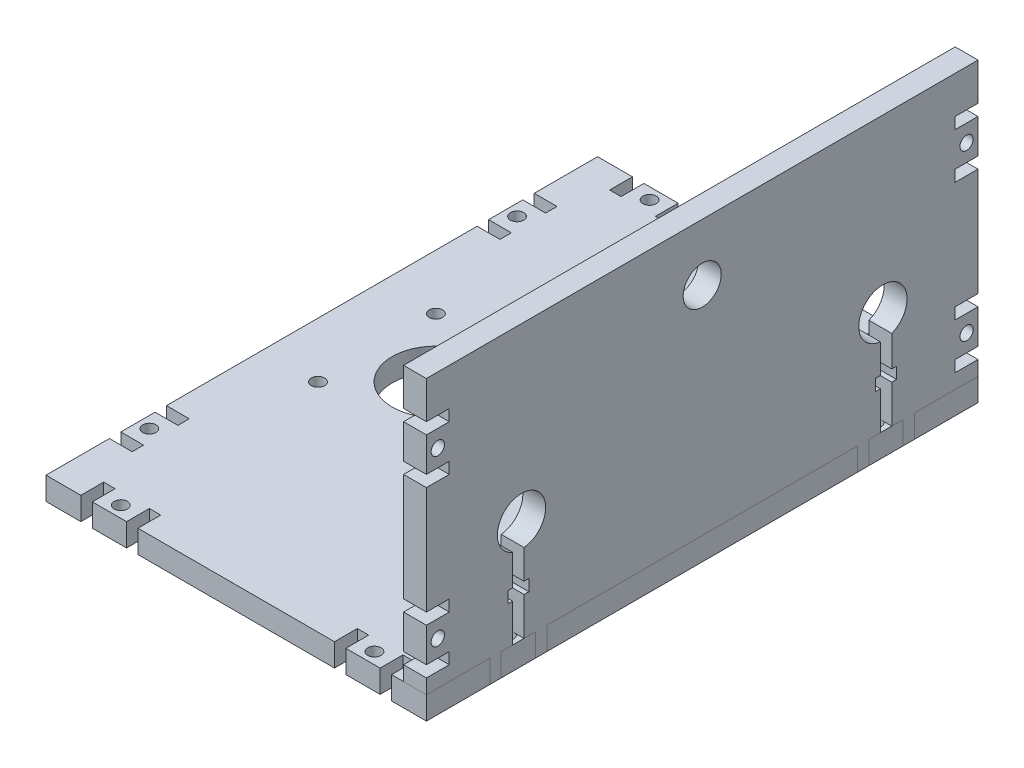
from build123d import *

# Parameters (mm, degrees)
SKETCH1_W           = 100
SKETCH1_H           = 145
BOSS_EXTRUDE1_DEPTH = 6
SKETCH2_R           = 1.75
SKETCH2_W           = 6
SKETCH2_H           = 3
SKETCH2_W_2         = 3
SKETCH2_H_2         = 6
CUT_EXTRUDE1_DEPTH  = 89.273722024
SKETCH3_R           = 11.5
SKETCH3_R_2         = 1.75
CUT_EXTRUDE2_DEPTH  = 89.273722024
BOSS_EXTRUDE2_DEPTH = 6
SKETCH5_R           = 1.75
SKETCH5_W           = 6
SKETCH5_H           = 3
CUT_EXTRUDE3_DEPTH  = 147.083024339
SKETCH6_R           = 5
SKETCH6_R_2         = 6.35
CUT_EXTRUDE4_DEPTH  = 147.083024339
CUT_EXTRUDE5_DEPTH  = 147.083024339


with BuildPart() as part:
    # Sketch1 → Boss-Extrude1 (new body)
    with BuildSketch(Plane(origin=(0, 0, 0), x_dir=(1, 0, 0), z_dir=(0, 1, 0))):
        Rectangle(SKETCH1_W, SKETCH1_H)
    extrude(amount=BOSS_EXTRUDE1_DEPTH)

    # Sketch2 → Cut-Extrude1 (cut, through all)
    with BuildSketch(Plane(origin=(0, 6, 0), x_dir=(1, 0, 0), z_dir=(0, 1, 0))):
        with Locations(Location((-33.333333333, 69.5, 0), (0, 0, 270))):
            Circle(SKETCH2_R)
        with Locations(Location((-47, 48.333333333, 0), (0, 0, 270))):
            Circle(SKETCH2_R)
        with Locations(Location((47, 48.333333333, 0), (0, 0, 90))):
            Circle(SKETCH2_R)
        with Locations(Location((33.333333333, 69.5, 0), (0, 0, 90))):
            Circle(SKETCH2_R)
        with Locations(Location((47, -48.333333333, 0), (0, 0, 270))):
            Circle(SKETCH2_R)
        with Locations(Location((33.333333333, -69.5, 0), (0, 0, 270))):
            Circle(SKETCH2_R)
        with Locations(Location((-47, -48.333333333, 0), (0, 0, 90))):
            Circle(SKETCH2_R)
        with Locations(Location((-33.333333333, -69.5, 0), (0, 0, 90))):
            Circle(SKETCH2_R)
        with Locations((-47, 54.333333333)):
            Rectangle(SKETCH2_W, SKETCH2_H)
        with Locations((-39.333333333, 69.5)):
            Rectangle(SKETCH2_W_2, SKETCH2_H_2)
        with Locations((-27.333333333, 69.5)):
            Rectangle(SKETCH2_W_2, SKETCH2_H_2)
        with Locations((-47, 42.333333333)):
            Rectangle(SKETCH2_W, SKETCH2_H)
        with Locations((47, 42.333333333)):
            Rectangle(SKETCH2_W, SKETCH2_H)
        with Locations((47, 54.333333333)):
            Rectangle(SKETCH2_W, SKETCH2_H)
        with Locations((39.333333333, 69.5)):
            Rectangle(SKETCH2_W_2, SKETCH2_H_2)
        with Locations((27.333333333, 69.5)):
            Rectangle(SKETCH2_W_2, SKETCH2_H_2)
        with Locations((47, -42.333333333)):
            Rectangle(SKETCH2_W, SKETCH2_H)
        with Locations((47, -54.333333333)):
            Rectangle(SKETCH2_W, SKETCH2_H)
        with Locations((39.333333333, -69.5)):
            Rectangle(SKETCH2_W_2, SKETCH2_H_2)
        with Locations((27.333333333, -69.5)):
            Rectangle(SKETCH2_W_2, SKETCH2_H_2)
        with Locations((-47, -42.333333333)):
            Rectangle(SKETCH2_W, SKETCH2_H)
        with Locations((-47, -54.333333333)):
            Rectangle(SKETCH2_W, SKETCH2_H)
        with Locations((-39.333333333, -69.5)):
            Rectangle(SKETCH2_W_2, SKETCH2_H_2)
        with Locations((-27.333333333, -69.5)):
            Rectangle(SKETCH2_W_2, SKETCH2_H_2)
    extrude(amount=-CUT_EXTRUDE1_DEPTH, mode=Mode.SUBTRACT)

    # Sketch3 → Cut-Extrude2 (cut, through all)
    with BuildSketch(Plane(origin=(0, 6, 0), x_dir=(1, 0, 0), z_dir=(0, 1, 0))):
        with Locations(Location((-20, 0, 0), (0, 0, 270))):
            Circle(SKETCH3_R)
        with Locations(Location((-4.5, 15.5, 0), (0, 0, 270))):
            Circle(SKETCH3_R_2)
        with Locations(Location((-35.5, 15.5, 0), (0, 0, 270))):
            Circle(SKETCH3_R_2)
        with Locations(Location((-35.5, -15.5, 0), (0, 0, 90))):
            Circle(SKETCH3_R_2)
        with Locations(Location((-4.5, -15.5, 0), (0, 0, 90))):
            Circle(SKETCH3_R_2)
    extrude(amount=-CUT_EXTRUDE2_DEPTH, mode=Mode.SUBTRACT)


with BuildPart() as body_2:
    # Sketch4 → Boss-Extrude2 (new body)
    with BuildSketch(Plane(origin=(44, 0, 0), x_dir=(0, 0, -1), z_dir=(1, 0, 0))):
        Polygon((-72.5, 6), (-55.833333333, 6), (-55.833333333, 0), (-52.833333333, 0), (-52.833333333, 6), (-43.833333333, 6), (-43.833333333, 0), (-40.833333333, 0), (-40.833333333, 6), (40.833333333, 6), (40.833333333, 0), (43.833333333, 0), (43.833333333, 6), (52.833333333, 6), (52.833333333, 0), (55.833333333, 0), (55.833333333, 6), (72.5, 6), (72.5, 78), (-72.5, 78), align=None)
    extrude(amount=BOSS_EXTRUDE2_DEPTH)

    # Sketch5 → Cut-Extrude3 (cut, through all)
    with BuildSketch(Plane(origin=(50, 0, 0), x_dir=(0, 0, -1), z_dir=(1, 0, 0))):
        with Locations((-69.5, 60.666666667)):
            Circle(SKETCH5_R)
        with Locations((-69.5, 17.333333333)):
            Circle(SKETCH5_R)
        with Locations((69.5, 17.333333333)):
            Circle(SKETCH5_R)
        with Locations((69.5, 60.666666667)):
            Circle(SKETCH5_R)
        with Locations((-69.5, 66.666666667)):
            Rectangle(SKETCH5_W, SKETCH5_H)
        with Locations((-69.5, 54.666666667)):
            Rectangle(SKETCH5_W, SKETCH5_H)
        with Locations((-69.5, 23.333333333)):
            Rectangle(SKETCH5_W, SKETCH5_H)
        with Locations((-69.5, 11.333333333)):
            Rectangle(SKETCH5_W, SKETCH5_H)
        with Locations((69.5, 11.333333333)):
            Rectangle(SKETCH5_W, SKETCH5_H)
        with Locations((69.5, 23.333333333)):
            Rectangle(SKETCH5_W, SKETCH5_H)
        with Locations((69.5, 54.666666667)):
            Rectangle(SKETCH5_W, SKETCH5_H)
        with Locations((69.5, 66.666666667)):
            Rectangle(SKETCH5_W, SKETCH5_H)
    extrude(amount=-CUT_EXTRUDE3_DEPTH, mode=Mode.SUBTRACT)

    # Sketch6 → Cut-Extrude4 (cut, through all)
    with BuildSketch(Plane(origin=(50, 0, 0), x_dir=(0, 0, -1), z_dir=(1, 0, 0))):
        with Locations((0, 63)):
            Circle(SKETCH6_R)
        with Locations((47.5, 33)):
            Circle(SKETCH6_R_2)
        with Locations((-47.5, 33)):
            Circle(SKETCH6_R_2)
    extrude(amount=-CUT_EXTRUDE4_DEPTH, mode=Mode.SUBTRACT)

    # Sketch7 → Cut-Extrude5 (cut, through all)
    with BuildSketch(Plane(origin=(50, 0, 0), x_dir=(0, 0, -1), z_dir=(1, 0, 0))):
        Polygon((-49.833333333, 6), (-46.833333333, 6), (-46.833333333, 16), (-45.577433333, 16), (-45.577433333, 19), (-46.833333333, 19), (-46.833333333, 30), (-49.833333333, 30), (-49.833333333, 19), (-51.089233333, 19), (-51.089233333, 16), (-49.833333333, 16), align=None)
        Polygon((46.833333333, 16), (45.577433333, 16), (45.577433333, 19), (46.833333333, 19), (46.833333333, 30), (49.833333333, 30), (49.833333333, 19), (51.089233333, 19), (51.089233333, 16), (49.833333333, 16), (49.833333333, 6), (46.833333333, 6), align=None)
    extrude(amount=-CUT_EXTRUDE5_DEPTH, mode=Mode.SUBTRACT)


solid = Compound([part.part, body_2.part])
